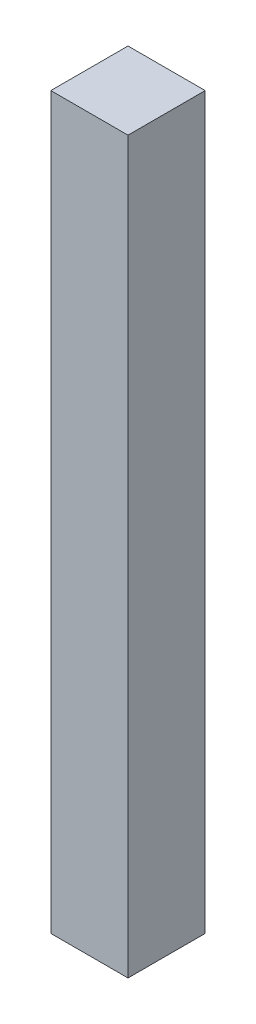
from build123d import *

# Parameters (mm, degrees)
SKETCH2_W           = 139.7
SKETCH2_H           = 139.7
BOSS_EXTRUDE1_DEPTH = 1320.8


with BuildPart() as part:
    # Sketch2 → Boss-Extrude1 (new body)
    with BuildSketch(Plane(origin=(0, 0, 0), x_dir=(1, 0, 0), z_dir=(0, 1, 0))):
        Rectangle(SKETCH2_W, SKETCH2_H)
    extrude(amount=BOSS_EXTRUDE1_DEPTH)


solid = part.part
